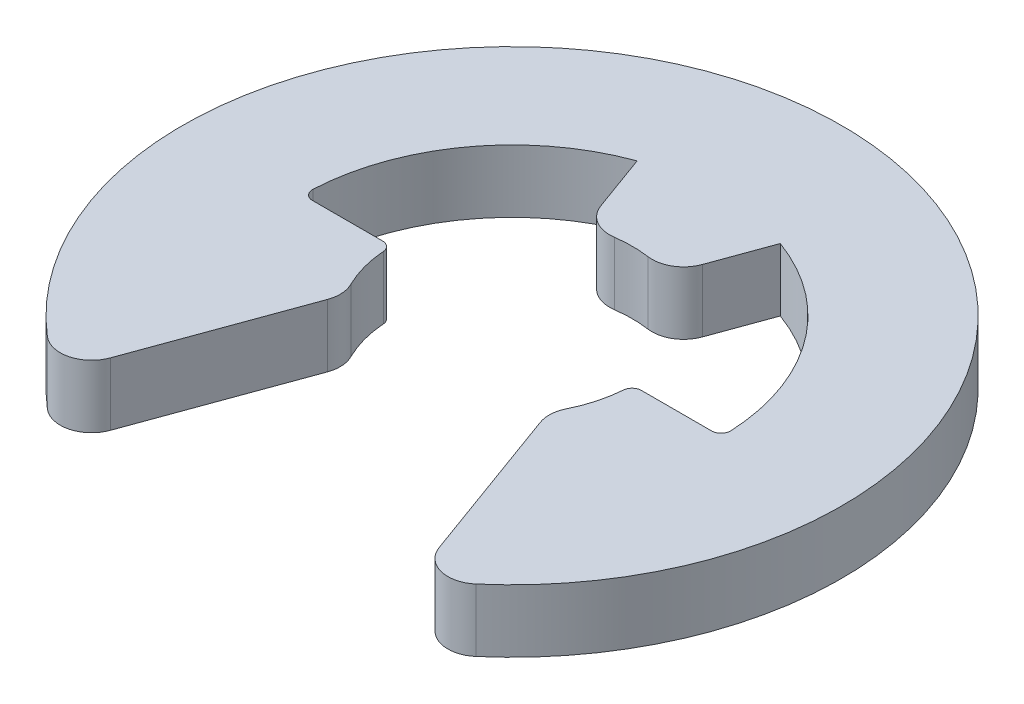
from build123d import *

# Parameters (mm, degrees)
BOSS_EXTRUDE1_DEPTH = 0.3
FILLET1_R           = 0.3
FILLET2_R           = 0.09


with BuildPart() as part:
    # Sketch2 → Boss-Extrude1 (new, symmetric)
    with BuildSketch(Plane(origin=(0, 0, 0), x_dir=(1, 0, 0), z_dir=(0, 1, 0))):
        with BuildLine():
            Line((-1.70840216, -2.646481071), (-0.97, -0.617737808))
            ThreePointArc((-0.97, -0.617737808), (-1.10408333, -0.321714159), (-1.15, 0))
            Line((-1.15, 0), (-2, 0))
            ThreePointArc((-2, 0), (-1.638304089, 1.147152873), (-0.684040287, 1.879385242))
            Line((-0.684040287, 1.879385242), (-0.393323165, 1.080646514))
            ThreePointArc((-0.393323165, 1.080646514), (0, 1.15), (0.393323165, 1.080646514))
            Line((0.393323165, 1.080646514), (0.684040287, 1.879385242))
            ThreePointArc((0.684040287, 1.879385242), (1.638304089, 1.147152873), (2, 0))
            Line((2, 0), (1.15, 0))
            ThreePointArc((1.15, 0), (1.10408333, -0.321714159), (0.97, -0.617737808))
            Line((0.97, -0.617737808), (1.70840216, -2.646481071))
            ThreePointArc((1.70840216, -2.646481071), (0, 3.15), (-1.70840216, -2.646481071))
        make_face()
    extrude(amount=BOSS_EXTRUDE1_DEPTH, both=True)

    # Fillet1
    fillet1_edges = [part.edges().sort_by_distance(p)[0] for p in [
        (-0.97, 0, 0.617737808),
        (-1.70840216, 0, 2.646481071),
        (1.70840216, 0, 2.646481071),
        (0.97, 0, 0.617737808),
        (0.393323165, 0, -1.080646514),
        (-0.393323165, 0, -1.080646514),
    ]]
    fillet(fillet1_edges, radius=FILLET1_R)

    # Fillet2
    fillet2_edges = [part.edges().sort_by_distance(p)[0] for p in [
        (-2, 0, 0),
        (-1.15, 0, 0),
        (1.15, 0, 0),
        (2, 0, 0),
    ]]
    fillet(fillet2_edges, radius=FILLET2_R)


solid = part.part
